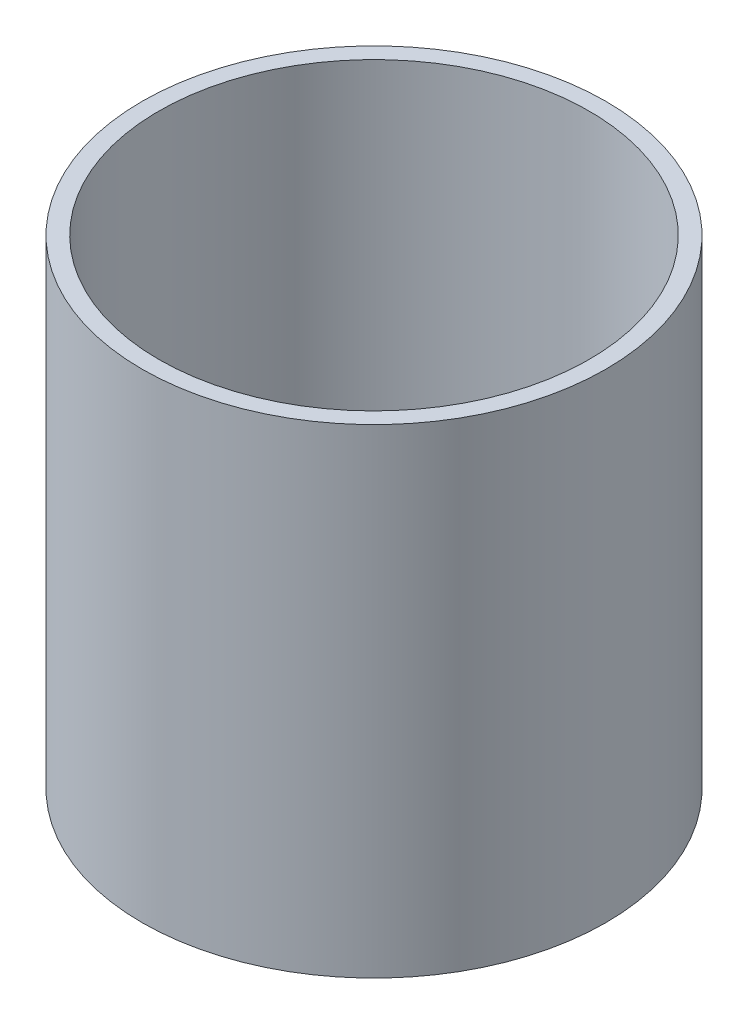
ISO-10303-21;
HEADER;
FILE_DESCRIPTION(('STEP AP214'),'2;1');
FILE_NAME('part.step','',(''),(''),'','','');
FILE_SCHEMA(('AUTOMOTIVE_DESIGN { 1 0 10303 214 1 1 1 1 }'));
ENDSEC;
DATA;
#1=APPLICATION_CONTEXT('core data for automotive mechanical design processes');
#2=APPLICATION_PROTOCOL_DEFINITION('international standard','automotive_design',2000,#1);
#3=PRODUCT_CONTEXT('',#1,'mechanical');
#4=PRODUCT('Part','Part','',(#3));
#5=PRODUCT_RELATED_PRODUCT_CATEGORY('part','',(#4));
#6=PRODUCT_DEFINITION_FORMATION('','',#4);
#7=PRODUCT_DEFINITION_CONTEXT('part definition',#1,'design');
#8=PRODUCT_DEFINITION('design','',#6,#7);
#9=PRODUCT_DEFINITION_SHAPE('','',#8);
#10=(LENGTH_UNIT() NAMED_UNIT(*) SI_UNIT(.MILLI.,.METRE.));
#11=(NAMED_UNIT(*) PLANE_ANGLE_UNIT() SI_UNIT($,.RADIAN.));
#12=(NAMED_UNIT(*) SI_UNIT($,.STERADIAN.) SOLID_ANGLE_UNIT());
#13=UNCERTAINTY_MEASURE_WITH_UNIT(LENGTH_MEASURE(1.E-05),#10,'distance_accuracy_value','');
#14=(GEOMETRIC_REPRESENTATION_CONTEXT(3) GLOBAL_UNCERTAINTY_ASSIGNED_CONTEXT((#13)) GLOBAL_UNIT_ASSIGNED_CONTEXT((#10,
#11,#12)) REPRESENTATION_CONTEXT('',''));
#15=CARTESIAN_POINT('',(0.,0.,0.));
#16=DIRECTION('',(0.,0.,1.));
#17=DIRECTION('',(1.,0.,0.));
#18=AXIS2_PLACEMENT_3D('',#15,#16,#17);
#19=CARTESIAN_POINT('',(0.,28.575,0.));
#20=DIRECTION('',(0.,1.,0.));
#21=DIRECTION('',(0.,0.,1.));
#22=AXIS2_PLACEMENT_3D('',#19,#20,#21);
#23=PLANE('',#22);
#24=CARTESIAN_POINT('',(0.,28.575,0.));
#25=DIRECTION('',(0.,1.,0.));
#26=DIRECTION('',(0.,0.,1.));
#27=AXIS2_PLACEMENT_3D('',#24,#25,#26);
#28=CIRCLE('',#27,13.827);
#29=CARTESIAN_POINT('',(0.,28.575,13.827));
#30=VERTEX_POINT('',#29);
#31=EDGE_CURVE('E10',#30,#30,#28,.T.);
#32=ORIENTED_EDGE('',*,*,#31,.T.);
#33=EDGE_LOOP('',(#32));
#34=FACE_BOUND('',#33,.T.);
#35=CARTESIAN_POINT('',(0.,28.575,0.));
#36=DIRECTION('',(0.,1.,0.));
#37=DIRECTION('',(0.,0.,1.));
#38=AXIS2_PLACEMENT_3D('',#35,#36,#37);
#39=CIRCLE('',#38,12.827);
#40=CARTESIAN_POINT('',(0.,28.575,12.827));
#41=VERTEX_POINT('',#40);
#42=EDGE_CURVE('E56',#41,#41,#39,.T.);
#43=ORIENTED_EDGE('',*,*,#42,.F.);
#44=EDGE_LOOP('',(#43));
#45=FACE_BOUND('',#44,.T.);
#46=ADVANCED_FACE('F43',(#34,#45),#23,.T.);
#47=CARTESIAN_POINT('',(0.,0.,0.));
#48=DIRECTION('',(0.,1.,0.));
#49=DIRECTION('',(0.,0.,1.));
#50=AXIS2_PLACEMENT_3D('',#47,#48,#49);
#51=PLANE('',#50);
#52=CARTESIAN_POINT('',(0.,0.,0.));
#53=DIRECTION('',(0.,1.,0.));
#54=DIRECTION('',(0.,0.,1.));
#55=AXIS2_PLACEMENT_3D('',#52,#53,#54);
#56=CIRCLE('',#55,13.827);
#57=CARTESIAN_POINT('',(0.,0.,13.827));
#58=VERTEX_POINT('',#57);
#59=EDGE_CURVE('E47',#58,#58,#56,.T.);
#60=ORIENTED_EDGE('',*,*,#59,.F.);
#61=EDGE_LOOP('',(#60));
#62=FACE_BOUND('',#61,.T.);
#63=CARTESIAN_POINT('',(0.,0.,0.));
#64=DIRECTION('',(0.,1.,0.));
#65=DIRECTION('',(0.,0.,1.));
#66=AXIS2_PLACEMENT_3D('',#63,#64,#65);
#67=CIRCLE('',#66,12.827);
#68=CARTESIAN_POINT('',(0.,0.,12.827));
#69=VERTEX_POINT('',#68);
#70=EDGE_CURVE('E58',#69,#69,#67,.T.);
#71=ORIENTED_EDGE('',*,*,#70,.T.);
#72=EDGE_LOOP('',(#71));
#73=FACE_BOUND('',#72,.T.);
#74=ADVANCED_FACE('F70',(#62,#73),#51,.F.);
#75=CARTESIAN_POINT('',(0.,28.575,0.));
#76=DIRECTION('',(0.,-1.,0.));
#77=DIRECTION('',(0.,0.,-1.));
#78=AXIS2_PLACEMENT_3D('',#75,#76,#77);
#79=CYLINDRICAL_SURFACE('',#78,13.827);
#80=ORIENTED_EDGE('',*,*,#31,.F.);
#81=EDGE_LOOP('',(#80));
#82=FACE_BOUND('',#81,.T.);
#83=ORIENTED_EDGE('',*,*,#59,.T.);
#84=EDGE_LOOP('',(#83));
#85=FACE_BOUND('',#84,.T.);
#86=ADVANCED_FACE('F45',(#82,#85),#79,.T.);
#87=CARTESIAN_POINT('',(0.,28.575,0.));
#88=DIRECTION('',(0.,-1.,0.));
#89=DIRECTION('',(0.,0.,-1.));
#90=AXIS2_PLACEMENT_3D('',#87,#88,#89);
#91=CYLINDRICAL_SURFACE('',#90,12.827);
#92=ORIENTED_EDGE('',*,*,#42,.T.);
#93=EDGE_LOOP('',(#92));
#94=FACE_BOUND('',#93,.T.);
#95=ORIENTED_EDGE('',*,*,#70,.F.);
#96=EDGE_LOOP('',(#95));
#97=FACE_BOUND('',#96,.T.);
#98=ADVANCED_FACE('F66',(#94,#97),#91,.F.);
#99=CLOSED_SHELL('',(#46,#74,#86,#98));
#100=MANIFOLD_SOLID_BREP('B2',#99);
#101=ADVANCED_BREP_SHAPE_REPRESENTATION('',(#18,#100),#14);
#102=SHAPE_DEFINITION_REPRESENTATION(#9,#101);
ENDSEC;
END-ISO-10303-21;
